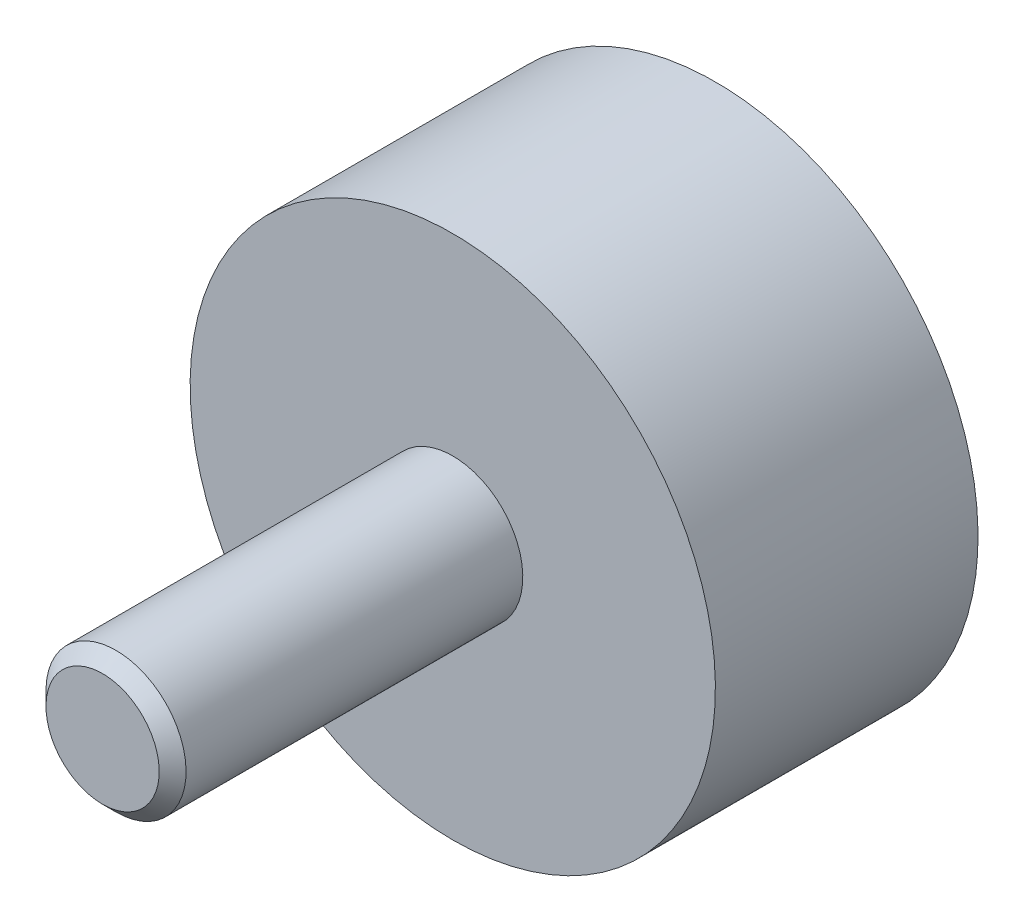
ISO-10303-21;
HEADER;
FILE_DESCRIPTION(('STEP AP214'),'2;1');
FILE_NAME('part.step','',(''),(''),'','','');
FILE_SCHEMA(('AUTOMOTIVE_DESIGN { 1 0 10303 214 1 1 1 1 }'));
ENDSEC;
DATA;
#1=APPLICATION_CONTEXT('core data for automotive mechanical design processes');
#2=APPLICATION_PROTOCOL_DEFINITION('international standard','automotive_design',2000,#1);
#3=PRODUCT_CONTEXT('',#1,'mechanical');
#4=PRODUCT('Part','Part','',(#3));
#5=PRODUCT_RELATED_PRODUCT_CATEGORY('part','',(#4));
#6=PRODUCT_DEFINITION_FORMATION('','',#4);
#7=PRODUCT_DEFINITION_CONTEXT('part definition',#1,'design');
#8=PRODUCT_DEFINITION('design','',#6,#7);
#9=PRODUCT_DEFINITION_SHAPE('','',#8);
#10=(LENGTH_UNIT() NAMED_UNIT(*) SI_UNIT(.MILLI.,.METRE.));
#11=(NAMED_UNIT(*) PLANE_ANGLE_UNIT() SI_UNIT($,.RADIAN.));
#12=(NAMED_UNIT(*) SI_UNIT($,.STERADIAN.) SOLID_ANGLE_UNIT());
#13=UNCERTAINTY_MEASURE_WITH_UNIT(LENGTH_MEASURE(1.E-05),#10,'distance_accuracy_value','');
#14=(GEOMETRIC_REPRESENTATION_CONTEXT(3) GLOBAL_UNCERTAINTY_ASSIGNED_CONTEXT((#13)) GLOBAL_UNIT_ASSIGNED_CONTEXT((#10,
#11,#12)) REPRESENTATION_CONTEXT('',''));
#15=CARTESIAN_POINT('',(0.,0.,0.));
#16=DIRECTION('',(0.,0.,1.));
#17=DIRECTION('',(1.,0.,0.));
#18=AXIS2_PLACEMENT_3D('',#15,#16,#17);
#19=CARTESIAN_POINT('',(14.,0.,15.));
#20=DIRECTION('',(0.,0.,1.));
#21=DIRECTION('',(0.,-1.,0.));
#22=AXIS2_PLACEMENT_3D('',#19,#20,#21);
#23=PLANE('',#22);
#24=CARTESIAN_POINT('',(0.,0.,15.));
#25=DIRECTION('',(0.,0.,1.));
#26=DIRECTION('',(0.,-1.,0.));
#27=AXIS2_PLACEMENT_3D('',#24,#25,#26);
#28=CIRCLE('',#27,4.);
#29=CARTESIAN_POINT('',(0.,-4.,15.));
#30=VERTEX_POINT('',#29);
#31=EDGE_CURVE('E23',#30,#30,#28,.T.);
#32=ORIENTED_EDGE('',*,*,#31,.F.);
#33=EDGE_LOOP('',(#32));
#34=FACE_BOUND('',#33,.T.);
#35=CARTESIAN_POINT('',(0.,0.,15.));
#36=DIRECTION('',(0.,0.,1.));
#37=DIRECTION('',(0.,-1.,0.));
#38=AXIS2_PLACEMENT_3D('',#35,#36,#37);
#39=CIRCLE('',#38,15.);
#40=CARTESIAN_POINT('',(0.,-15.,15.));
#41=VERTEX_POINT('',#40);
#42=EDGE_CURVE('E27',#41,#41,#39,.T.);
#43=ORIENTED_EDGE('',*,*,#42,.T.);
#44=EDGE_LOOP('',(#43));
#45=FACE_BOUND('',#44,.T.);
#46=ADVANCED_FACE('F12',(#34,#45),#23,.T.);
#47=CARTESIAN_POINT('',(0.,0.,0.5));
#48=DIRECTION('',(0.,0.,1.));
#49=DIRECTION('',(0.,-1.,0.));
#50=AXIS2_PLACEMENT_3D('',#47,#48,#49);
#51=CYLINDRICAL_SURFACE('',#50,15.);
#52=CARTESIAN_POINT('',(0.,0.,0.));
#53=DIRECTION('',(0.,0.,1.));
#54=DIRECTION('',(0.,-1.,0.));
#55=AXIS2_PLACEMENT_3D('',#52,#53,#54);
#56=CIRCLE('',#55,15.);
#57=CARTESIAN_POINT('',(0.,-15.,0.));
#58=VERTEX_POINT('',#57);
#59=EDGE_CURVE('E32',#58,#58,#56,.T.);
#60=ORIENTED_EDGE('',*,*,#59,.T.);
#61=EDGE_LOOP('',(#60));
#62=FACE_BOUND('',#61,.T.);
#63=ORIENTED_EDGE('',*,*,#42,.F.);
#64=EDGE_LOOP('',(#63));
#65=FACE_BOUND('',#64,.T.);
#66=ADVANCED_FACE('F64',(#62,#65),#51,.T.);
#67=CARTESIAN_POINT('',(15.,0.,0.));
#68=DIRECTION('',(0.,0.,-1.));
#69=DIRECTION('',(0.,1.,0.));
#70=AXIS2_PLACEMENT_3D('',#67,#68,#69);
#71=PLANE('',#70);
#72=CARTESIAN_POINT('',(0.,0.,0.));
#73=DIRECTION('',(0.,0.,-1.));
#74=DIRECTION('',(0.,1.,0.));
#75=AXIS2_PLACEMENT_3D('',#72,#73,#74);
#76=CIRCLE('',#75,4.45);
#77=CARTESIAN_POINT('',(0.,4.45,0.));
#78=VERTEX_POINT('',#77);
#79=EDGE_CURVE('E8',#78,#78,#76,.F.);
#80=ORIENTED_EDGE('',*,*,#79,.T.);
#81=EDGE_LOOP('',(#80));
#82=FACE_BOUND('',#81,.T.);
#83=ORIENTED_EDGE('',*,*,#59,.F.);
#84=EDGE_LOOP('',(#83));
#85=FACE_BOUND('',#84,.T.);
#86=ADVANCED_FACE('F70',(#82,#85),#71,.T.);
#87=CARTESIAN_POINT('',(0.,0.,35.));
#88=DIRECTION('',(0.,0.,1.));
#89=DIRECTION('',(0.,-1.,0.));
#90=AXIS2_PLACEMENT_3D('',#87,#88,#89);
#91=PLANE('',#90);
#92=CARTESIAN_POINT('',(0.,0.,35.));
#93=DIRECTION('',(0.,0.,1.));
#94=DIRECTION('',(0.,-1.,0.));
#95=AXIS2_PLACEMENT_3D('',#92,#93,#94);
#96=CIRCLE('',#95,3.233);
#97=CARTESIAN_POINT('',(0.,-3.233,35.));
#98=VERTEX_POINT('',#97);
#99=EDGE_CURVE('E35',#98,#98,#96,.T.);
#100=ORIENTED_EDGE('',*,*,#99,.T.);
#101=EDGE_LOOP('',(#100));
#102=FACE_BOUND('',#101,.T.);
#103=ADVANCED_FACE('F76',(#102),#91,.T.);
#104=CARTESIAN_POINT('',(0.,0.,35.));
#105=DIRECTION('',(0.,0.,-1.));
#106=DIRECTION('',(0.,1.,0.));
#107=AXIS2_PLACEMENT_3D('',#104,#105,#106);
#108=CONICAL_SURFACE('',#107,3.233,0.785398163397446);
#109=CARTESIAN_POINT('',(0.,0.,34.233));
#110=DIRECTION('',(0.,0.,1.));
#111=DIRECTION('',(0.,-1.,0.));
#112=AXIS2_PLACEMENT_3D('',#109,#110,#111);
#113=CIRCLE('',#112,4.);
#114=CARTESIAN_POINT('',(0.,-4.,34.233));
#115=VERTEX_POINT('',#114);
#116=EDGE_CURVE('E38',#115,#115,#113,.T.);
#117=ORIENTED_EDGE('',*,*,#116,.T.);
#118=EDGE_LOOP('',(#117));
#119=FACE_BOUND('',#118,.T.);
#120=ORIENTED_EDGE('',*,*,#99,.F.);
#121=EDGE_LOOP('',(#120));
#122=FACE_BOUND('',#121,.T.);
#123=ADVANCED_FACE('F58',(#119,#122),#108,.T.);
#124=CARTESIAN_POINT('',(0.,0.,15.));
#125=DIRECTION('',(0.,0.,1.));
#126=DIRECTION('',(0.,-1.,0.));
#127=AXIS2_PLACEMENT_3D('',#124,#125,#126);
#128=CYLINDRICAL_SURFACE('',#127,4.);
#129=ORIENTED_EDGE('',*,*,#31,.T.);
#130=EDGE_LOOP('',(#129));
#131=FACE_BOUND('',#130,.T.);
#132=ORIENTED_EDGE('',*,*,#116,.F.);
#133=EDGE_LOOP('',(#132));
#134=FACE_BOUND('',#133,.T.);
#135=ADVANCED_FACE('F49',(#131,#134),#128,.T.);
#136=CARTESIAN_POINT('',(0.,0.,0.));
#137=DIRECTION('',(0.,0.,1.));
#138=DIRECTION('',(0.,-1.,0.));
#139=AXIS2_PLACEMENT_3D('',#136,#137,#138);
#140=CYLINDRICAL_SURFACE('',#139,4.);
#141=CARTESIAN_POINT('',(0.,0.,0.449999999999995));
#142=DIRECTION('',(0.,0.,-1.));
#143=DIRECTION('',(0.,1.,0.));
#144=AXIS2_PLACEMENT_3D('',#141,#142,#143);
#145=CIRCLE('',#144,4.);
#146=CARTESIAN_POINT('',(0.,4.,0.449999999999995));
#147=VERTEX_POINT('',#146);
#148=EDGE_CURVE('E19',#147,#147,#145,.T.);
#149=ORIENTED_EDGE('',*,*,#148,.T.);
#150=EDGE_LOOP('',(#149));
#151=FACE_BOUND('',#150,.T.);
#152=CARTESIAN_POINT('',(0.,0.,8.));
#153=DIRECTION('',(0.,0.,-1.));
#154=DIRECTION('',(-1.,0.,0.));
#155=AXIS2_PLACEMENT_3D('',#152,#153,#154);
#156=CIRCLE('',#155,4.);
#157=CARTESIAN_POINT('',(-4.,0.,8.));
#158=VERTEX_POINT('',#157);
#159=EDGE_CURVE('E41',#158,#158,#156,.T.);
#160=ORIENTED_EDGE('',*,*,#159,.F.);
#161=EDGE_LOOP('',(#160));
#162=FACE_BOUND('',#161,.T.);
#163=ADVANCED_FACE('F47',(#151,#162),#140,.F.);
#164=CARTESIAN_POINT('',(0.,0.,0.449999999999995));
#165=DIRECTION('',(0.,0.,-1.));
#166=DIRECTION('',(0.,1.,0.));
#167=AXIS2_PLACEMENT_3D('',#164,#165,#166);
#168=CONICAL_SURFACE('',#167,4.,0.785398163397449);
#169=ORIENTED_EDGE('',*,*,#79,.F.);
#170=EDGE_LOOP('',(#169));
#171=FACE_BOUND('',#170,.T.);
#172=ORIENTED_EDGE('',*,*,#148,.F.);
#173=EDGE_LOOP('',(#172));
#174=FACE_BOUND('',#173,.T.);
#175=ADVANCED_FACE('F14',(#171,#174),#168,.F.);
#176=CARTESIAN_POINT('',(0.,0.,8.));
#177=DIRECTION('',(0.,0.,-1.));
#178=DIRECTION('',(-1.,0.,0.));
#179=AXIS2_PLACEMENT_3D('',#176,#177,#178);
#180=PLANE('',#179);
#181=ORIENTED_EDGE('',*,*,#159,.T.);
#182=EDGE_LOOP('',(#181));
#183=FACE_BOUND('',#182,.T.);
#184=ADVANCED_FACE('F45',(#183),#180,.T.);
#185=CLOSED_SHELL('',(#46,#66,#86,#103,#123,#135,#163,#175,#184));
#186=MANIFOLD_SOLID_BREP('B1',#185);
#187=ADVANCED_BREP_SHAPE_REPRESENTATION('',(#18,#186),#14);
#188=SHAPE_DEFINITION_REPRESENTATION(#9,#187);
ENDSEC;
END-ISO-10303-21;
